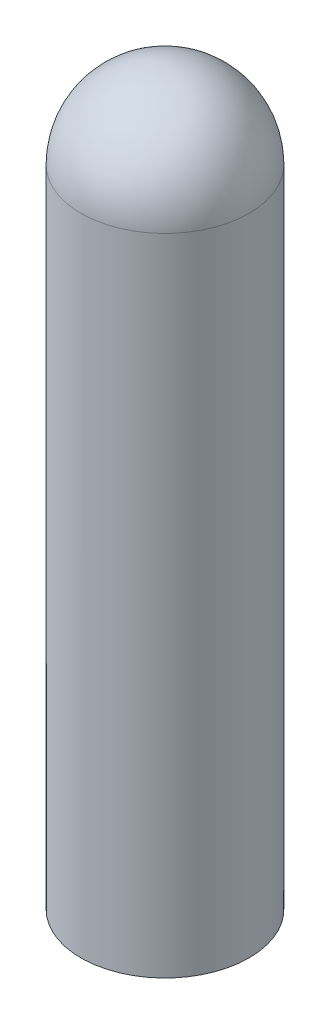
ISO-10303-21;
HEADER;
FILE_DESCRIPTION(('STEP AP214'),'2;1');
FILE_NAME('part.step','',(''),(''),'','','');
FILE_SCHEMA(('AUTOMOTIVE_DESIGN { 1 0 10303 214 1 1 1 1 }'));
ENDSEC;
DATA;
#1=APPLICATION_CONTEXT('core data for automotive mechanical design processes');
#2=APPLICATION_PROTOCOL_DEFINITION('international standard','automotive_design',2000,#1);
#3=PRODUCT_CONTEXT('',#1,'mechanical');
#4=PRODUCT('Part','Part','',(#3));
#5=PRODUCT_RELATED_PRODUCT_CATEGORY('part','',(#4));
#6=PRODUCT_DEFINITION_FORMATION('','',#4);
#7=PRODUCT_DEFINITION_CONTEXT('part definition',#1,'design');
#8=PRODUCT_DEFINITION('design','',#6,#7);
#9=PRODUCT_DEFINITION_SHAPE('','',#8);
#10=(LENGTH_UNIT() NAMED_UNIT(*) SI_UNIT(.MILLI.,.METRE.));
#11=(NAMED_UNIT(*) PLANE_ANGLE_UNIT() SI_UNIT($,.RADIAN.));
#12=(NAMED_UNIT(*) SI_UNIT($,.STERADIAN.) SOLID_ANGLE_UNIT());
#13=UNCERTAINTY_MEASURE_WITH_UNIT(LENGTH_MEASURE(1.E-05),#10,'distance_accuracy_value','');
#14=(GEOMETRIC_REPRESENTATION_CONTEXT(3) GLOBAL_UNCERTAINTY_ASSIGNED_CONTEXT((#13)) GLOBAL_UNIT_ASSIGNED_CONTEXT((#10,
#11,#12)) REPRESENTATION_CONTEXT('',''));
#15=CARTESIAN_POINT('',(0.,0.,0.));
#16=DIRECTION('',(0.,0.,1.));
#17=DIRECTION('',(1.,0.,0.));
#18=AXIS2_PLACEMENT_3D('',#15,#16,#17);
#19=CARTESIAN_POINT('',(74.625,91.0231669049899,0.));
#20=DIRECTION('',(0.,-1.,0.));
#21=DIRECTION('',(1.,0.,0.));
#22=AXIS2_PLACEMENT_3D('',#19,#20,#21);
#23=CYLINDRICAL_SURFACE('',#22,1.4925);
#24=CARTESIAN_POINT('',(74.625,89.5306669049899,0.));
#25=DIRECTION('',(0.,-1.,0.));
#26=DIRECTION('',(0.,0.,-1.));
#27=AXIS2_PLACEMENT_3D('',#24,#25,#26);
#28=CIRCLE('',#27,1.4925);
#29=CARTESIAN_POINT('',(74.625,89.5306669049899,-1.4925));
#30=VERTEX_POINT('',#29);
#31=EDGE_CURVE('E10',#30,#30,#28,.T.);
#32=ORIENTED_EDGE('',*,*,#31,.T.);
#33=EDGE_LOOP('',(#32));
#34=FACE_BOUND('',#33,.T.);
#35=CARTESIAN_POINT('',(74.625,78.0881669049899,0.));
#36=DIRECTION('',(0.,-1.,0.));
#37=DIRECTION('',(1.,0.,0.));
#38=AXIS2_PLACEMENT_3D('',#35,#36,#37);
#39=CIRCLE('',#38,1.4925);
#40=CARTESIAN_POINT('',(76.1175,78.0881669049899,0.));
#41=VERTEX_POINT('',#40);
#42=EDGE_CURVE('E21',#41,#41,#39,.T.);
#43=ORIENTED_EDGE('',*,*,#42,.F.);
#44=EDGE_LOOP('',(#43));
#45=FACE_BOUND('',#44,.T.);
#46=ADVANCED_FACE('F14',(#34,#45),#23,.T.);
#47=CARTESIAN_POINT('',(74.625,78.0881669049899,0.));
#48=DIRECTION('',(0.,-1.,0.));
#49=DIRECTION('',(1.,0.,0.));
#50=AXIS2_PLACEMENT_3D('',#47,#48,#49);
#51=PLANE('',#50);
#52=ORIENTED_EDGE('',*,*,#42,.T.);
#53=EDGE_LOOP('',(#52));
#54=FACE_BOUND('',#53,.T.);
#55=ADVANCED_FACE('F32',(#54),#51,.T.);
#56=CARTESIAN_POINT('',(74.625,89.5306669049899,0.));
#57=DIRECTION('',(0.,0.,1.));
#58=DIRECTION('',(1.,0.,0.));
#59=AXIS2_PLACEMENT_3D('',#56,#57,#58);
#60=SPHERICAL_SURFACE('',#59,1.4925);
#61=CARTESIAN_POINT('',(74.625,89.5306669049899,0.));
#62=DIRECTION('',(0.,-1.,0.));
#63=DIRECTION('',(0.,0.,-1.));
#64=AXIS2_PLACEMENT_3D('',#61,#62,#63);
#65=SPHERICAL_SURFACE('',#64,1.4925);
#66=ORIENTED_EDGE('',*,*,#31,.F.);
#67=EDGE_LOOP('',(#66));
#68=FACE_BOUND('',#67,.T.);
#69=ADVANCED_FACE('F39',(#68),#65,.T.);
#70=CLOSED_SHELL('',(#46,#55,#69));
#71=MANIFOLD_SOLID_BREP('B1',#70);
#72=ADVANCED_BREP_SHAPE_REPRESENTATION('',(#18,#71),#14);
#73=SHAPE_DEFINITION_REPRESENTATION(#9,#72);
ENDSEC;
END-ISO-10303-21;
